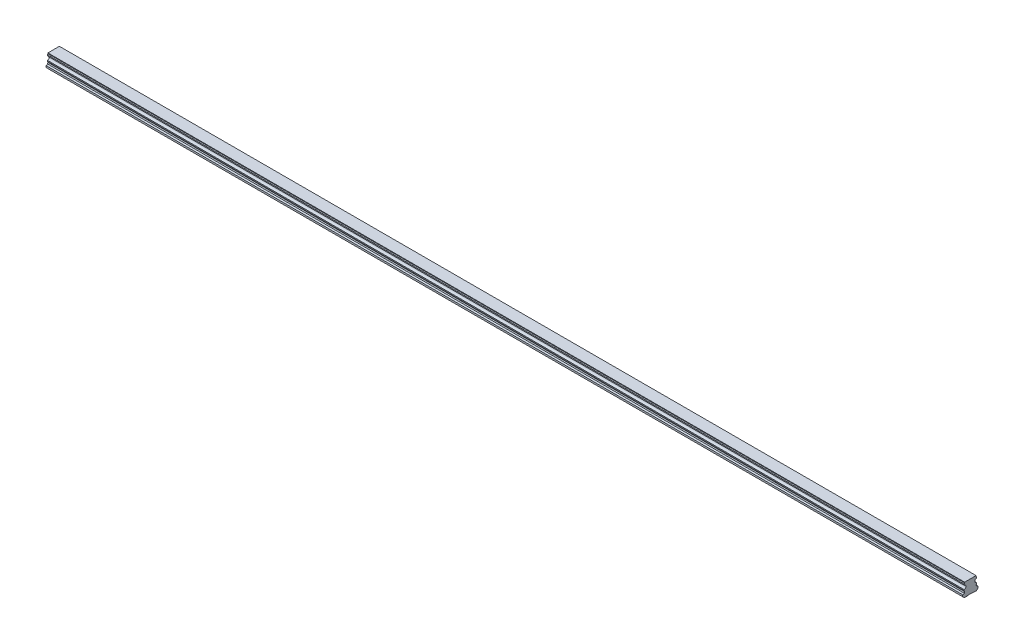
from build123d import *

# Parameters (mm, degrees)
BOSS_EXTRUDE1_DEPTH        = 1500
SKETCH3_R                  = 3
SKETCH3_R_2                = 2.5
CUT_EXTRUDE3_DEPTH         = 12
SKETCH3_2_R                = 2.5
CUT_EXTRUDE4_DEPTH         = 15
CHAMFER1_SIZE              = 0.5
LPATTERN4_COUNT            = 25
LPATTERN4_PITCH            = 60
CHAMFER1_OF_LPATTERN4_SIZE = 0.5


with BuildPart() as part:
    # Sketch1 → Boss-Extrude1 (new body)
    with BuildSketch(Plane(origin=(0, 0, 0), x_dir=(0, 0, -1), z_dir=(1, 0, 0))):
        with BuildLine():
            Line((9.375, 21.8), (-9.375, 21.8))
            Line((-9.375, 21.8), (-9.375, 20.756))
            Line((-9.375, 20.756), (-10, 19.415683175))
            Line((-10, 19.415683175), (-10, 17.685449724))
            ThreePointArc((-10, 17.685449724), (-7.2, 14.6), (-10, 11.514550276))
            Line((-10, 11.514550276), (-10, 9.784316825))
            Line((-10, 9.784316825), (-9.375, 8.444))
            Line((-9.375, 8.444), (-9.922688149, 6.4))
            Line((-9.922688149, 6.4), (-12.5, 5.489338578))
            Line((-12.5, 5.489338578), (-12.5, 2.65))
            Line((-12.5, 2.65), (-9.85, 0))
            Line((-9.85, 0), (-5.5, 0))
            Line((-5.5, 0), (-5, 0.5))
            Line((-5, 0.5), (5, 0.5))
            Line((5, 0.5), (5.5, 0))
            Line((5.5, 0), (9.85, 0))
            Line((9.85, 0), (12.5, 2.65))
            Line((12.5, 2.65), (12.5, 5.489338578))
            Line((12.5, 5.489338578), (9.922688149, 6.4))
            Line((9.922688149, 6.4), (9.375, 8.444))
            Line((9.375, 8.444), (10, 9.784316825))
            Line((10, 9.784316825), (10, 11.514550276))
            ThreePointArc((10, 11.514550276), (7.2, 14.6), (10, 17.685449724))
            Line((10, 17.685449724), (10, 19.415683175))
            Line((10, 19.415683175), (9.375, 20.756))
            Line((9.375, 20.756), (9.375, 21.8))
        make_face()
    extrude(amount=BOSS_EXTRUDE1_DEPTH)

    # Sketch3 → Cut-Extrude3 (cut)
    with BuildSketch(Plane.XZ):
        with Locations(Location((30, 0, 0), (0, 0, 270))):
            Circle(SKETCH3_R)
        with Locations(Location((30, 0, 0), (0, 0, 270))):
            Circle(SKETCH3_R_2, mode=Mode.SUBTRACT)
    cut_extrude3 = extrude(amount=-CUT_EXTRUDE3_DEPTH, mode=Mode.SUBTRACT)

    # Sketch3_2 → Cut-Extrude4 (cut)
    with BuildSketch(Plane.XZ):
        with Locations(Location((30, 0, 0), (0, 0, 270))):
            Circle(SKETCH3_2_R)
    cut_extrude4 = extrude(amount=-CUT_EXTRUDE4_DEPTH, mode=Mode.SUBTRACT)

    # Cut-Extrude5 cone 1 section (on through the dimple's axis) → Cut-Extrude5 (revolve, cut)
    with BuildSketch(Plane(origin=(30, 15, 0), x_dir=(0, 0, -1), z_dir=(1, 0, 0))):
        Polygon((0, 0), (2.5, 0), (0, 1.443375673), align=None)
    cut_extrude5 = revolve(axis=Axis((30, 15, 0), (0, 1, 0)), mode=Mode.SUBTRACT)

    # Chamfer1
    chamfer1_edges = [part.edges().sort_by_distance(p)[0] for p in [
        (30, 0.5, 3),
    ]]
    chamfer(chamfer1_edges, length=CHAMFER1_SIZE)

    # LPattern4: Cut-Extrude3, Cut-Extrude4, Cut-Extrude5 ×25
    with Locations(*[(i * LPATTERN4_PITCH, 0, 0) for i in range(1, LPATTERN4_COUNT)]):
        add(cut_extrude3, mode=Mode.SUBTRACT)
        add(cut_extrude4, mode=Mode.SUBTRACT)
        add(cut_extrude5, mode=Mode.SUBTRACT)

    # Chamfer1 of LPattern4
    chamfer1_of_lpattern4_edges = [part.edges().sort_by_distance(p)[0] for p in [
        (90, 0.5, 3),
        (150, 0.5, 3),
        (210, 0.5, 3),
        (270, 0.5, 3),
        (330, 0.5, 3),
        (390, 0.5, 3),
        (450, 0.5, 3),
        (510, 0.5, 3),
        (570, 0.5, 3),
        (630, 0.5, 3),
        (690, 0.5, 3),
        (750, 0.5, 3),
        (810, 0.5, 3),
        (870, 0.5, 3),
        (930, 0.5, 3),
        (990, 0.5, 3),
        (1050, 0.5, 3),
        (1110, 0.5, 3),
        (1170, 0.5, 3),
        (1230, 0.5, 3),
        (1290, 0.5, 3),
        (1350, 0.5, 3),
        (1410, 0.5, 3),
        (1470, 0.5, 3),
    ]]
    chamfer(chamfer1_of_lpattern4_edges, length=CHAMFER1_OF_LPATTERN4_SIZE)


solid = part.part
